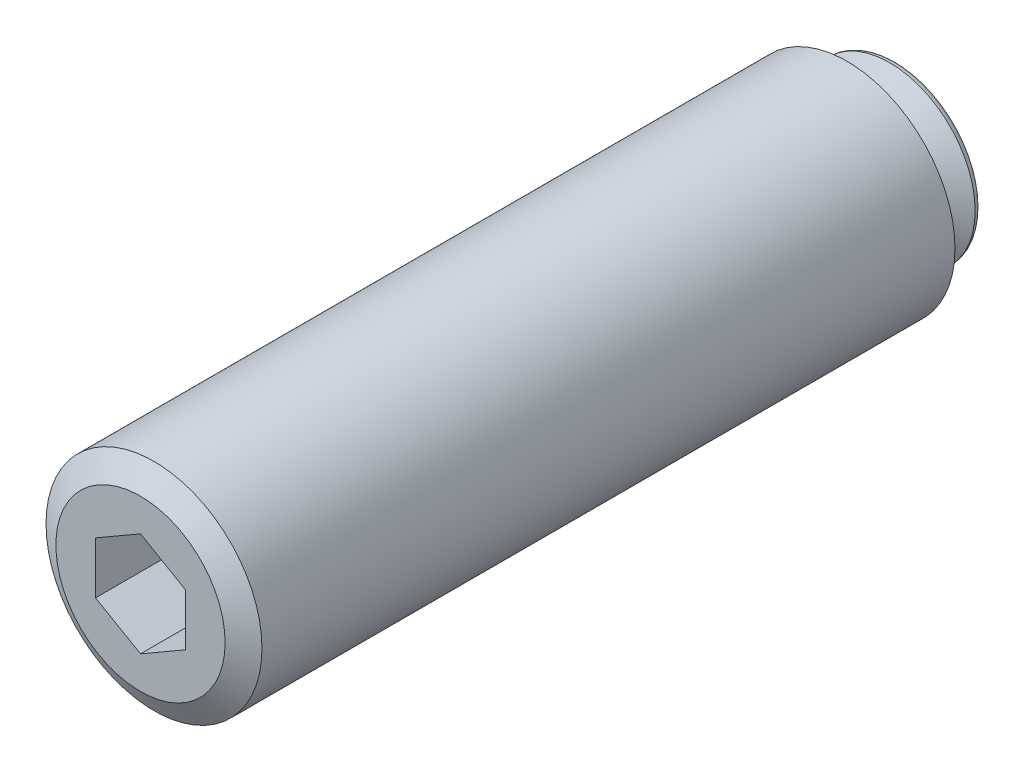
ISO-10303-21;
HEADER;
FILE_DESCRIPTION(('STEP AP214'),'2;1');
FILE_NAME('part.step','',(''),(''),'','','');
FILE_SCHEMA(('AUTOMOTIVE_DESIGN { 1 0 10303 214 1 1 1 1 }'));
ENDSEC;
DATA;
#1=APPLICATION_CONTEXT('core data for automotive mechanical design processes');
#2=APPLICATION_PROTOCOL_DEFINITION('international standard','automotive_design',2000,#1);
#3=PRODUCT_CONTEXT('',#1,'mechanical');
#4=PRODUCT('Part','Part','',(#3));
#5=PRODUCT_RELATED_PRODUCT_CATEGORY('part','',(#4));
#6=PRODUCT_DEFINITION_FORMATION('','',#4);
#7=PRODUCT_DEFINITION_CONTEXT('part definition',#1,'design');
#8=PRODUCT_DEFINITION('design','',#6,#7);
#9=PRODUCT_DEFINITION_SHAPE('','',#8);
#10=(LENGTH_UNIT() NAMED_UNIT(*) SI_UNIT(.MILLI.,.METRE.));
#11=(NAMED_UNIT(*) PLANE_ANGLE_UNIT() SI_UNIT($,.RADIAN.));
#12=(NAMED_UNIT(*) SI_UNIT($,.STERADIAN.) SOLID_ANGLE_UNIT());
#13=UNCERTAINTY_MEASURE_WITH_UNIT(LENGTH_MEASURE(1.E-05),#10,'distance_accuracy_value','');
#14=(GEOMETRIC_REPRESENTATION_CONTEXT(3) GLOBAL_UNCERTAINTY_ASSIGNED_CONTEXT((#13)) GLOBAL_UNIT_ASSIGNED_CONTEXT((#10,
#11,#12)) REPRESENTATION_CONTEXT('',''));
#15=CARTESIAN_POINT('',(0.,0.,0.));
#16=DIRECTION('',(0.,0.,1.));
#17=DIRECTION('',(1.,0.,0.));
#18=AXIS2_PLACEMENT_3D('',#15,#16,#17);
#19=CARTESIAN_POINT('',(0.,0.,84.));
#20=DIRECTION('',(0.,0.,1.));
#21=DIRECTION('',(1.,0.,0.));
#22=AXIS2_PLACEMENT_3D('',#19,#20,#21);
#23=PLANE('',#22);
#24=DIRECTION('',(-0.866025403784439,0.5,0.));
#25=VECTOR('',#24,1.);
#26=CARTESIAN_POINT('',(5.,2.88675134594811,84.));
#27=LINE('',#26,#25);
#28=CARTESIAN_POINT('',(5.,2.88675134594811,84.));
#29=VERTEX_POINT('',#28);
#30=CARTESIAN_POINT('',(0.,5.77350269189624,84.));
#31=VERTEX_POINT('',#30);
#32=EDGE_CURVE('E28',#29,#31,#27,.T.);
#33=ORIENTED_EDGE('',*,*,#32,.F.);
#34=DIRECTION('',(0.,1.,0.));
#35=VECTOR('',#34,1.);
#36=CARTESIAN_POINT('',(5.,-2.88675134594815,84.));
#37=LINE('',#36,#35);
#38=CARTESIAN_POINT('',(5.,-2.88675134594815,84.));
#39=VERTEX_POINT('',#38);
#40=EDGE_CURVE('E111',#39,#29,#37,.T.);
#41=ORIENTED_EDGE('',*,*,#40,.F.);
#42=DIRECTION('',(0.866025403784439,0.5,0.));
#43=VECTOR('',#42,1.);
#44=CARTESIAN_POINT('',(0.,-5.77350269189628,84.));
#45=LINE('',#44,#43);
#46=CARTESIAN_POINT('',(0.,-5.77350269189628,84.));
#47=VERTEX_POINT('',#46);
#48=EDGE_CURVE('E109',#47,#39,#45,.T.);
#49=ORIENTED_EDGE('',*,*,#48,.F.);
#50=DIRECTION('',(0.866025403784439,-0.5,0.));
#51=VECTOR('',#50,1.);
#52=CARTESIAN_POINT('',(-5.,-2.88675134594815,84.));
#53=LINE('',#52,#51);
#54=CARTESIAN_POINT('',(-5.,-2.88675134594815,84.));
#55=VERTEX_POINT('',#54);
#56=EDGE_CURVE('E76',#55,#47,#53,.T.);
#57=ORIENTED_EDGE('',*,*,#56,.F.);
#58=DIRECTION('',(0.,-1.,0.));
#59=VECTOR('',#58,1.);
#60=CARTESIAN_POINT('',(-5.,2.88675134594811,84.));
#61=LINE('',#60,#59);
#62=CARTESIAN_POINT('',(-5.,2.88675134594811,84.));
#63=VERTEX_POINT('',#62);
#64=EDGE_CURVE('E105',#63,#55,#61,.T.);
#65=ORIENTED_EDGE('',*,*,#64,.F.);
#66=DIRECTION('',(-0.866025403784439,-0.5,0.));
#67=VECTOR('',#66,1.);
#68=CARTESIAN_POINT('',(0.,5.77350269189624,84.));
#69=LINE('',#68,#67);
#70=EDGE_CURVE('E102',#31,#63,#69,.T.);
#71=ORIENTED_EDGE('',*,*,#70,.F.);
#72=EDGE_LOOP('',(#33,#41,#49,#57,#65,#71));
#73=FACE_BOUND('',#72,.T.);
#74=CARTESIAN_POINT('',(0.,0.,84.));
#75=DIRECTION('',(0.,0.,1.));
#76=DIRECTION('',(1.,0.,0.));
#77=AXIS2_PLACEMENT_3D('',#74,#75,#76);
#78=CIRCLE('',#77,9.401924);
#79=CARTESIAN_POINT('',(9.401924,0.,84.));
#80=VERTEX_POINT('',#79);
#81=EDGE_CURVE('E9',#80,#80,#78,.T.);
#82=ORIENTED_EDGE('',*,*,#81,.T.);
#83=EDGE_LOOP('',(#82));
#84=FACE_BOUND('',#83,.T.);
#85=ADVANCED_FACE('F14',(#73,#84),#23,.T.);
#86=CARTESIAN_POINT('',(0.,0.,84.));
#87=DIRECTION('',(0.,0.,-1.));
#88=DIRECTION('',(-1.,0.,0.));
#89=AXIS2_PLACEMENT_3D('',#86,#87,#88);
#90=CONICAL_SURFACE('',#89,9.401924,1.04719751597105);
#91=CARTESIAN_POINT('',(0.,0.,82.5));
#92=DIRECTION('',(0.,0.,1.));
#93=DIRECTION('',(1.,0.,0.));
#94=AXIS2_PLACEMENT_3D('',#91,#92,#93);
#95=CIRCLE('',#94,12.);
#96=CARTESIAN_POINT('',(12.,0.,82.5));
#97=VERTEX_POINT('',#96);
#98=EDGE_CURVE('E21',#97,#97,#95,.T.);
#99=ORIENTED_EDGE('',*,*,#98,.T.);
#100=EDGE_LOOP('',(#99));
#101=FACE_BOUND('',#100,.T.);
#102=ORIENTED_EDGE('',*,*,#81,.F.);
#103=EDGE_LOOP('',(#102));
#104=FACE_BOUND('',#103,.T.);
#105=ADVANCED_FACE('F149',(#101,#104),#90,.T.);
#106=CARTESIAN_POINT('',(0.,0.,87.));
#107=DIRECTION('',(0.,0.,1.));
#108=DIRECTION('',(1.,0.,0.));
#109=AXIS2_PLACEMENT_3D('',#106,#107,#108);
#110=CYLINDRICAL_SURFACE('',#109,12.);
#111=CARTESIAN_POINT('',(0.,0.,5.5));
#112=DIRECTION('',(0.,0.,1.));
#113=DIRECTION('',(1.,0.,0.));
#114=AXIS2_PLACEMENT_3D('',#111,#112,#113);
#115=CIRCLE('',#114,12.);
#116=CARTESIAN_POINT('',(12.,0.,5.5));
#117=VERTEX_POINT('',#116);
#118=EDGE_CURVE('E144',#117,#117,#115,.T.);
#119=ORIENTED_EDGE('',*,*,#118,.T.);
#120=EDGE_LOOP('',(#119));
#121=FACE_BOUND('',#120,.T.);
#122=ORIENTED_EDGE('',*,*,#98,.F.);
#123=EDGE_LOOP('',(#122));
#124=FACE_BOUND('',#123,.T.);
#125=ADVANCED_FACE('F152',(#121,#124),#110,.T.);
#126=CARTESIAN_POINT('',(0.,0.,5.5));
#127=DIRECTION('',(0.,0.,1.));
#128=DIRECTION('',(1.,0.,0.));
#129=AXIS2_PLACEMENT_3D('',#126,#127,#128);
#130=CONICAL_SURFACE('',#129,12.,1.04719751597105);
#131=CARTESIAN_POINT('',(0.,0.,4.));
#132=DIRECTION('',(0.,0.,1.));
#133=DIRECTION('',(1.,0.,0.));
#134=AXIS2_PLACEMENT_3D('',#131,#132,#133);
#135=CIRCLE('',#134,9.401924);
#136=CARTESIAN_POINT('',(9.401924,0.,4.));
#137=VERTEX_POINT('',#136);
#138=EDGE_CURVE('E141',#137,#137,#135,.T.);
#139=ORIENTED_EDGE('',*,*,#138,.T.);
#140=EDGE_LOOP('',(#139));
#141=FACE_BOUND('',#140,.T.);
#142=ORIENTED_EDGE('',*,*,#118,.F.);
#143=EDGE_LOOP('',(#142));
#144=FACE_BOUND('',#143,.T.);
#145=ADVANCED_FACE('F154',(#141,#144),#130,.T.);
#146=CARTESIAN_POINT('',(0.,6.96704537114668,4.));
#147=DIRECTION('',(0.,0.,-1.));
#148=DIRECTION('',(-1.,0.,0.));
#149=AXIS2_PLACEMENT_3D('',#146,#147,#148);
#150=PLANE('',#149);
#151=CARTESIAN_POINT('',(0.,0.,4.));
#152=DIRECTION('',(0.,0.,1.));
#153=DIRECTION('',(1.,0.,0.));
#154=AXIS2_PLACEMENT_3D('',#151,#152,#153);
#155=CIRCLE('',#154,6.96704537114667);
#156=CARTESIAN_POINT('',(6.96704537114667,0.,4.));
#157=VERTEX_POINT('',#156);
#158=EDGE_CURVE('E138',#157,#157,#155,.T.);
#159=ORIENTED_EDGE('',*,*,#158,.T.);
#160=EDGE_LOOP('',(#159));
#161=FACE_BOUND('',#160,.T.);
#162=ORIENTED_EDGE('',*,*,#138,.F.);
#163=EDGE_LOOP('',(#162));
#164=FACE_BOUND('',#163,.T.);
#165=ADVANCED_FACE('F163',(#161,#164),#150,.T.);
#166=CARTESIAN_POINT('',(0.,0.,4.));
#167=DIRECTION('',(0.,0.,1.));
#168=DIRECTION('',(1.,0.,0.));
#169=AXIS2_PLACEMENT_3D('',#166,#167,#168);
#170=CONICAL_SURFACE('',#169,6.96704537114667,0.392621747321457);
#171=CARTESIAN_POINT('',(0.,0.,3.78746603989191));
#172=DIRECTION('',(0.,0.,1.));
#173=DIRECTION('',(1.,0.,0.));
#174=AXIS2_PLACEMENT_3D('',#171,#172,#173);
#175=CIRCLE('',#174,6.87903017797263);
#176=CARTESIAN_POINT('',(6.87903017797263,0.,3.78746603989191));
#177=VERTEX_POINT('',#176);
#178=EDGE_CURVE('E135',#177,#177,#175,.T.);
#179=ORIENTED_EDGE('',*,*,#178,.T.);
#180=EDGE_LOOP('',(#179));
#181=FACE_BOUND('',#180,.T.);
#182=ORIENTED_EDGE('',*,*,#158,.F.);
#183=EDGE_LOOP('',(#182));
#184=FACE_BOUND('',#183,.T.);
#185=ADVANCED_FACE('F214',(#181,#184),#170,.T.);
#186=CARTESIAN_POINT('',(0.,0.,3.6862679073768));
#187=DIRECTION('',(0.,0.,1.));
#188=DIRECTION('',(1.,0.,0.));
#189=AXIS2_PLACEMENT_3D('',#186,#187,#188);
#190=TOROIDAL_SURFACE('',#189,7.112,0.253999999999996);
#191=CARTESIAN_POINT('',(0.,0.,3.6862679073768));
#192=DIRECTION('',(0.,0.,1.));
#193=DIRECTION('',(1.,0.,0.));
#194=AXIS2_PLACEMENT_3D('',#191,#192,#193);
#195=CIRCLE('',#194,6.858);
#196=CARTESIAN_POINT('',(6.858,0.,3.6862679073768));
#197=VERTEX_POINT('',#196);
#198=EDGE_CURVE('E132',#197,#197,#195,.T.);
#199=ORIENTED_EDGE('',*,*,#198,.T.);
#200=EDGE_LOOP('',(#199));
#201=FACE_BOUND('',#200,.T.);
#202=ORIENTED_EDGE('',*,*,#178,.F.);
#203=EDGE_LOOP('',(#202));
#204=FACE_BOUND('',#203,.T.);
#205=ADVANCED_FACE('F210',(#201,#204),#190,.F.);
#206=CARTESIAN_POINT('',(0.,0.,87.));
#207=DIRECTION('',(0.,0.,1.));
#208=DIRECTION('',(1.,0.,0.));
#209=AXIS2_PLACEMENT_3D('',#206,#207,#208);
#210=CYLINDRICAL_SURFACE('',#209,6.858);
#211=CARTESIAN_POINT('',(0.,0.,2.43400637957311));
#212=DIRECTION('',(0.,0.,1.));
#213=DIRECTION('',(1.,0.,0.));
#214=AXIS2_PLACEMENT_3D('',#211,#212,#213);
#215=CIRCLE('',#214,6.858);
#216=CARTESIAN_POINT('',(6.858,0.,2.43400637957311));
#217=VERTEX_POINT('',#216);
#218=EDGE_CURVE('E129',#217,#217,#215,.T.);
#219=ORIENTED_EDGE('',*,*,#218,.T.);
#220=EDGE_LOOP('',(#219));
#221=FACE_BOUND('',#220,.T.);
#222=ORIENTED_EDGE('',*,*,#198,.F.);
#223=EDGE_LOOP('',(#222));
#224=FACE_BOUND('',#223,.T.);
#225=ADVANCED_FACE('F206',(#221,#224),#210,.T.);
#226=CARTESIAN_POINT('',(0.,0.,2.43400637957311));
#227=DIRECTION('',(0.,0.,1.));
#228=DIRECTION('',(1.,0.,0.));
#229=AXIS2_PLACEMENT_3D('',#226,#227,#228);
#230=TOROIDAL_SURFACE('',#229,7.112,0.25400000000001);
#231=CARTESIAN_POINT('',(0.,0.,2.2140359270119));
#232=DIRECTION('',(0.,0.,1.));
#233=DIRECTION('',(1.,0.,0.));
#234=AXIS2_PLACEMENT_3D('',#231,#232,#233);
#235=CIRCLE('',#234,6.985);
#236=CARTESIAN_POINT('',(6.985,0.,2.2140359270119));
#237=VERTEX_POINT('',#236);
#238=EDGE_CURVE('E126',#237,#237,#235,.T.);
#239=ORIENTED_EDGE('',*,*,#238,.T.);
#240=EDGE_LOOP('',(#239));
#241=FACE_BOUND('',#240,.T.);
#242=ORIENTED_EDGE('',*,*,#218,.F.);
#243=EDGE_LOOP('',(#242));
#244=FACE_BOUND('',#243,.T.);
#245=ADVANCED_FACE('F202',(#241,#244),#230,.F.);
#246=CARTESIAN_POINT('',(0.,0.,2.2140359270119));
#247=DIRECTION('',(0.,0.,-1.));
#248=DIRECTION('',(-1.,0.,0.));
#249=AXIS2_PLACEMENT_3D('',#246,#247,#248);
#250=CONICAL_SURFACE('',#249,6.985,1.04719755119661);
#251=CARTESIAN_POINT('',(0.,0.,0.762));
#252=DIRECTION('',(0.,0.,1.));
#253=DIRECTION('',(1.,0.,0.));
#254=AXIS2_PLACEMENT_3D('',#251,#252,#253);
#255=CIRCLE('',#254,9.5);
#256=CARTESIAN_POINT('',(9.5,0.,0.762));
#257=VERTEX_POINT('',#256);
#258=EDGE_CURVE('E123',#257,#257,#255,.T.);
#259=ORIENTED_EDGE('',*,*,#258,.T.);
#260=EDGE_LOOP('',(#259));
#261=FACE_BOUND('',#260,.T.);
#262=ORIENTED_EDGE('',*,*,#238,.F.);
#263=EDGE_LOOP('',(#262));
#264=FACE_BOUND('',#263,.T.);
#265=ADVANCED_FACE('F198',(#261,#264),#250,.T.);
#266=CARTESIAN_POINT('',(0.,0.,0.762));
#267=DIRECTION('',(0.,0.,1.));
#268=DIRECTION('',(1.,0.,0.));
#269=AXIS2_PLACEMENT_3D('',#266,#267,#268);
#270=TOROIDAL_SURFACE('',#269,8.738,0.762);
#271=CARTESIAN_POINT('',(0.,0.,0.));
#272=DIRECTION('',(0.,0.,1.));
#273=DIRECTION('',(1.,0.,0.));
#274=AXIS2_PLACEMENT_3D('',#271,#272,#273);
#275=CIRCLE('',#274,8.738);
#276=CARTESIAN_POINT('',(8.738,0.,0.));
#277=VERTEX_POINT('',#276);
#278=EDGE_CURVE('E115',#277,#277,#275,.T.);
#279=ORIENTED_EDGE('',*,*,#278,.T.);
#280=EDGE_LOOP('',(#279));
#281=FACE_BOUND('',#280,.T.);
#282=ORIENTED_EDGE('',*,*,#258,.F.);
#283=EDGE_LOOP('',(#282));
#284=FACE_BOUND('',#283,.T.);
#285=ADVANCED_FACE('F190',(#281,#284),#270,.T.);
#286=CARTESIAN_POINT('',(0.,0.,0.));
#287=DIRECTION('',(0.,0.,-1.));
#288=DIRECTION('',(-1.,0.,0.));
#289=AXIS2_PLACEMENT_3D('',#286,#287,#288);
#290=PLANE('',#289);
#291=ORIENTED_EDGE('',*,*,#278,.F.);
#292=EDGE_LOOP('',(#291));
#293=FACE_BOUND('',#292,.T.);
#294=ADVANCED_FACE('F182',(#293),#290,.T.);
#295=CARTESIAN_POINT('',(5.,2.88675134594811,76.));
#296=DIRECTION('',(0.5,0.866025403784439,0.));
#297=DIRECTION('',(-0.866025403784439,0.5,0.));
#298=AXIS2_PLACEMENT_3D('',#295,#296,#297);
#299=PLANE('',#298);
#300=ORIENTED_EDGE('',*,*,#32,.T.);
#301=DIRECTION('',(0.,0.,1.));
#302=VECTOR('',#301,1.);
#303=CARTESIAN_POINT('',(0.,5.77350269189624,76.));
#304=LINE('',#303,#302);
#305=CARTESIAN_POINT('',(0.,5.77350269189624,76.));
#306=VERTEX_POINT('',#305);
#307=EDGE_CURVE('E58',#306,#31,#304,.T.);
#308=ORIENTED_EDGE('',*,*,#307,.F.);
#309=DIRECTION('',(-0.866025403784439,0.5,0.));
#310=VECTOR('',#309,1.);
#311=CARTESIAN_POINT('',(5.,2.88675134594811,76.));
#312=LINE('',#311,#310);
#313=CARTESIAN_POINT('',(5.,2.88675134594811,76.));
#314=VERTEX_POINT('',#313);
#315=EDGE_CURVE('E113',#314,#306,#312,.T.);
#316=ORIENTED_EDGE('',*,*,#315,.F.);
#317=DIRECTION('',(0.,0.,1.));
#318=VECTOR('',#317,1.);
#319=CARTESIAN_POINT('',(5.,2.88675134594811,76.));
#320=LINE('',#319,#318);
#321=EDGE_CURVE('E36',#314,#29,#320,.T.);
#322=ORIENTED_EDGE('',*,*,#321,.T.);
#323=EDGE_LOOP('',(#300,#308,#316,#322));
#324=FACE_BOUND('',#323,.T.);
#325=ADVANCED_FACE('F179',(#324),#299,.F.);
#326=CARTESIAN_POINT('',(5.,-2.88675134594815,76.));
#327=DIRECTION('',(1.,0.,0.));
#328=DIRECTION('',(0.,0.,-1.));
#329=AXIS2_PLACEMENT_3D('',#326,#327,#328);
#330=PLANE('',#329);
#331=ORIENTED_EDGE('',*,*,#40,.T.);
#332=ORIENTED_EDGE('',*,*,#321,.F.);
#333=DIRECTION('',(0.,1.,0.));
#334=VECTOR('',#333,1.);
#335=CARTESIAN_POINT('',(5.,-2.88675134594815,76.));
#336=LINE('',#335,#334);
#337=CARTESIAN_POINT('',(5.,-2.88675134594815,76.));
#338=VERTEX_POINT('',#337);
#339=EDGE_CURVE('E88',#338,#314,#336,.T.);
#340=ORIENTED_EDGE('',*,*,#339,.F.);
#341=DIRECTION('',(0.,0.,1.));
#342=VECTOR('',#341,1.);
#343=CARTESIAN_POINT('',(5.,-2.88675134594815,76.));
#344=LINE('',#343,#342);
#345=EDGE_CURVE('E80',#338,#39,#344,.T.);
#346=ORIENTED_EDGE('',*,*,#345,.T.);
#347=EDGE_LOOP('',(#331,#332,#340,#346));
#348=FACE_BOUND('',#347,.T.);
#349=ADVANCED_FACE('F181',(#348),#330,.F.);
#350=CARTESIAN_POINT('',(0.,-5.77350269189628,76.));
#351=DIRECTION('',(0.5,-0.866025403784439,0.));
#352=DIRECTION('',(0.866025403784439,0.5,0.));
#353=AXIS2_PLACEMENT_3D('',#350,#351,#352);
#354=PLANE('',#353);
#355=ORIENTED_EDGE('',*,*,#48,.T.);
#356=ORIENTED_EDGE('',*,*,#345,.F.);
#357=DIRECTION('',(0.866025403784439,0.5,0.));
#358=VECTOR('',#357,1.);
#359=CARTESIAN_POINT('',(0.,-5.77350269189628,76.));
#360=LINE('',#359,#358);
#361=CARTESIAN_POINT('',(0.,-5.77350269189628,76.));
#362=VERTEX_POINT('',#361);
#363=EDGE_CURVE('E84',#362,#338,#360,.T.);
#364=ORIENTED_EDGE('',*,*,#363,.F.);
#365=DIRECTION('',(0.,0.,1.));
#366=VECTOR('',#365,1.);
#367=CARTESIAN_POINT('',(0.,-5.77350269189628,76.));
#368=LINE('',#367,#366);
#369=EDGE_CURVE('E69',#362,#47,#368,.T.);
#370=ORIENTED_EDGE('',*,*,#369,.T.);
#371=EDGE_LOOP('',(#355,#356,#364,#370));
#372=FACE_BOUND('',#371,.T.);
#373=ADVANCED_FACE('F85',(#372),#354,.F.);
#374=CARTESIAN_POINT('',(-5.,-2.88675134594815,76.));
#375=DIRECTION('',(-0.5,-0.866025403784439,0.));
#376=DIRECTION('',(0.866025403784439,-0.5,0.));
#377=AXIS2_PLACEMENT_3D('',#374,#375,#376);
#378=PLANE('',#377);
#379=ORIENTED_EDGE('',*,*,#56,.T.);
#380=ORIENTED_EDGE('',*,*,#369,.F.);
#381=DIRECTION('',(0.866025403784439,-0.5,0.));
#382=VECTOR('',#381,1.);
#383=CARTESIAN_POINT('',(-5.,-2.88675134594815,76.));
#384=LINE('',#383,#382);
#385=CARTESIAN_POINT('',(-5.,-2.88675134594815,76.));
#386=VERTEX_POINT('',#385);
#387=EDGE_CURVE('E73',#386,#362,#384,.T.);
#388=ORIENTED_EDGE('',*,*,#387,.F.);
#389=DIRECTION('',(0.,0.,1.));
#390=VECTOR('',#389,1.);
#391=CARTESIAN_POINT('',(-5.,-2.88675134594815,76.));
#392=LINE('',#391,#390);
#393=EDGE_CURVE('E81',#386,#55,#392,.T.);
#394=ORIENTED_EDGE('',*,*,#393,.T.);
#395=EDGE_LOOP('',(#379,#380,#388,#394));
#396=FACE_BOUND('',#395,.T.);
#397=ADVANCED_FACE('F71',(#396),#378,.F.);
#398=CARTESIAN_POINT('',(-5.,2.88675134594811,76.));
#399=DIRECTION('',(-1.,0.,0.));
#400=DIRECTION('',(0.,0.,1.));
#401=AXIS2_PLACEMENT_3D('',#398,#399,#400);
#402=PLANE('',#401);
#403=ORIENTED_EDGE('',*,*,#64,.T.);
#404=ORIENTED_EDGE('',*,*,#393,.F.);
#405=DIRECTION('',(0.,-1.,0.));
#406=VECTOR('',#405,1.);
#407=CARTESIAN_POINT('',(-5.,2.88675134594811,76.));
#408=LINE('',#407,#406);
#409=CARTESIAN_POINT('',(-5.,2.88675134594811,76.));
#410=VERTEX_POINT('',#409);
#411=EDGE_CURVE('E94',#410,#386,#408,.T.);
#412=ORIENTED_EDGE('',*,*,#411,.F.);
#413=DIRECTION('',(0.,0.,1.));
#414=VECTOR('',#413,1.);
#415=CARTESIAN_POINT('',(-5.,2.88675134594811,76.));
#416=LINE('',#415,#414);
#417=EDGE_CURVE('E118',#410,#63,#416,.T.);
#418=ORIENTED_EDGE('',*,*,#417,.T.);
#419=EDGE_LOOP('',(#403,#404,#412,#418));
#420=FACE_BOUND('',#419,.T.);
#421=ADVANCED_FACE('F321',(#420),#402,.F.);
#422=CARTESIAN_POINT('',(0.,5.77350269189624,76.));
#423=DIRECTION('',(-0.5,0.866025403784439,0.));
#424=DIRECTION('',(-0.866025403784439,-0.5,0.));
#425=AXIS2_PLACEMENT_3D('',#422,#423,#424);
#426=PLANE('',#425);
#427=ORIENTED_EDGE('',*,*,#70,.T.);
#428=ORIENTED_EDGE('',*,*,#417,.F.);
#429=DIRECTION('',(-0.866025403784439,-0.5,0.));
#430=VECTOR('',#429,1.);
#431=CARTESIAN_POINT('',(0.,5.77350269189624,76.));
#432=LINE('',#431,#430);
#433=EDGE_CURVE('E96',#306,#410,#432,.T.);
#434=ORIENTED_EDGE('',*,*,#433,.F.);
#435=ORIENTED_EDGE('',*,*,#307,.T.);
#436=EDGE_LOOP('',(#427,#428,#434,#435));
#437=FACE_BOUND('',#436,.T.);
#438=ADVANCED_FACE('F177',(#437),#426,.F.);
#439=CARTESIAN_POINT('',(0.,5.77350269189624,76.));
#440=DIRECTION('',(0.,0.,1.));
#441=DIRECTION('',(1.,0.,0.));
#442=AXIS2_PLACEMENT_3D('',#439,#440,#441);
#443=PLANE('',#442);
#444=ORIENTED_EDGE('',*,*,#315,.T.);
#445=ORIENTED_EDGE('',*,*,#433,.T.);
#446=ORIENTED_EDGE('',*,*,#411,.T.);
#447=ORIENTED_EDGE('',*,*,#387,.T.);
#448=ORIENTED_EDGE('',*,*,#363,.T.);
#449=ORIENTED_EDGE('',*,*,#339,.T.);
#450=EDGE_LOOP('',(#444,#445,#446,#447,#448,#449));
#451=FACE_BOUND('',#450,.T.);
#452=ADVANCED_FACE('F91',(#451),#443,.T.);
#453=CLOSED_SHELL('',(#85,#105,#125,#145,#165,#185,#205,#225,#245,#265,#285,#294,#325,#349,#373,
#397,#421,#438,#452));
#454=MANIFOLD_SOLID_BREP('B1',#453);
#455=ADVANCED_BREP_SHAPE_REPRESENTATION('',(#18,#454),#14);
#456=SHAPE_DEFINITION_REPRESENTATION(#9,#455);
ENDSEC;
END-ISO-10303-21;
